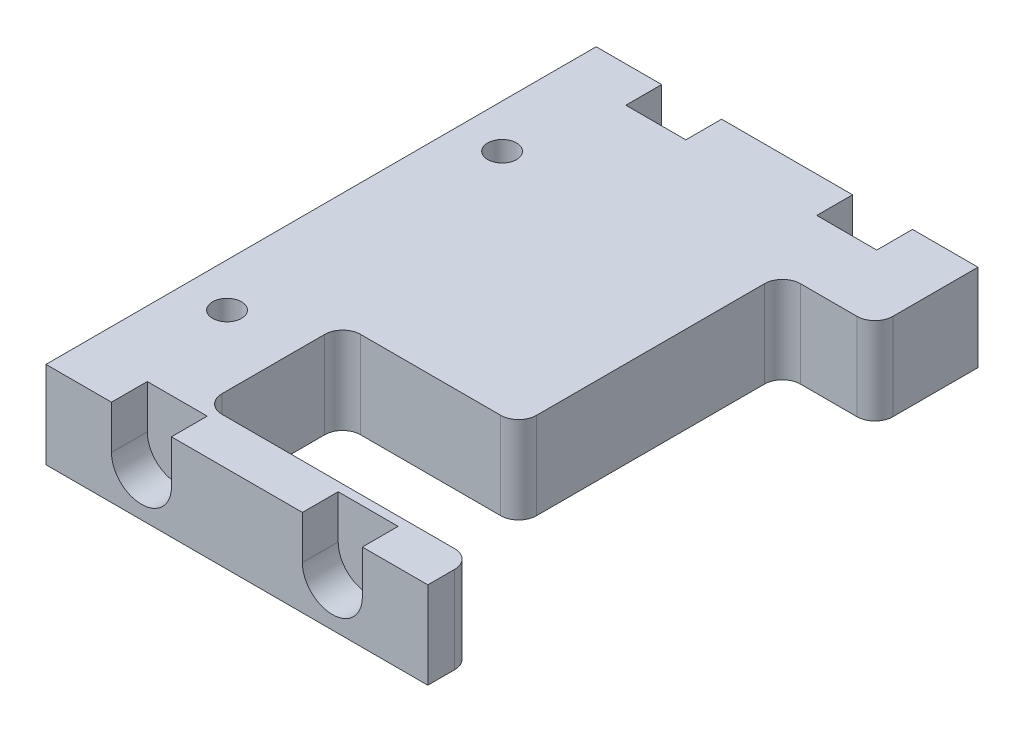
ISO-10303-21;
HEADER;
FILE_DESCRIPTION(('STEP AP214'),'2;1');
FILE_NAME('part.step','',(''),(''),'','','');
FILE_SCHEMA(('AUTOMOTIVE_DESIGN { 1 0 10303 214 1 1 1 1 }'));
ENDSEC;
DATA;
#1=APPLICATION_CONTEXT('core data for automotive mechanical design processes');
#2=APPLICATION_PROTOCOL_DEFINITION('international standard','automotive_design',2000,#1);
#3=PRODUCT_CONTEXT('',#1,'mechanical');
#4=PRODUCT('Part','Part','',(#3));
#5=PRODUCT_RELATED_PRODUCT_CATEGORY('part','',(#4));
#6=PRODUCT_DEFINITION_FORMATION('','',#4);
#7=PRODUCT_DEFINITION_CONTEXT('part definition',#1,'design');
#8=PRODUCT_DEFINITION('design','',#6,#7);
#9=PRODUCT_DEFINITION_SHAPE('','',#8);
#10=(LENGTH_UNIT() NAMED_UNIT(*) SI_UNIT(.MILLI.,.METRE.));
#11=(NAMED_UNIT(*) PLANE_ANGLE_UNIT() SI_UNIT($,.RADIAN.));
#12=(NAMED_UNIT(*) SI_UNIT($,.STERADIAN.) SOLID_ANGLE_UNIT());
#13=UNCERTAINTY_MEASURE_WITH_UNIT(LENGTH_MEASURE(1.E-05),#10,'distance_accuracy_value','');
#14=(GEOMETRIC_REPRESENTATION_CONTEXT(3) GLOBAL_UNCERTAINTY_ASSIGNED_CONTEXT((#13)) GLOBAL_UNIT_ASSIGNED_CONTEXT((#10,
#11,#12)) REPRESENTATION_CONTEXT('',''));
#15=CARTESIAN_POINT('',(0.,0.,0.));
#16=DIRECTION('',(0.,0.,1.));
#17=DIRECTION('',(1.,0.,0.));
#18=AXIS2_PLACEMENT_3D('',#15,#16,#17);
#19=CARTESIAN_POINT('',(-899.286453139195,561.091856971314,0.));
#20=DIRECTION('',(0.,1.,0.));
#21=DIRECTION('',(0.,0.,1.));
#22=AXIS2_PLACEMENT_3D('',#19,#20,#21);
#23=PLANE('',#22);
#24=CARTESIAN_POINT('',(-827.241549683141,561.091856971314,-58.5597));
#25=DIRECTION('',(0.,-1.,0.));
#26=DIRECTION('',(0.,0.,-1.));
#27=AXIS2_PLACEMENT_3D('',#24,#25,#26);
#28=CIRCLE('',#27,2.05000000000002);
#29=CARTESIAN_POINT('',(-827.241549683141,561.091856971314,-60.6097));
#30=VERTEX_POINT('',#29);
#31=EDGE_CURVE('E345',#30,#30,#28,.T.);
#32=ORIENTED_EDGE('',*,*,#31,.T.);
#33=EDGE_LOOP('',(#32));
#34=FACE_BOUND('',#33,.T.);
#35=CARTESIAN_POINT('',(-827.241549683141,561.091856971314,-19.5199));
#36=DIRECTION('',(0.,-1.,0.));
#37=DIRECTION('',(0.,0.,-1.));
#38=AXIS2_PLACEMENT_3D('',#35,#36,#37);
#39=CIRCLE('',#38,2.05000000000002);
#40=CARTESIAN_POINT('',(-827.241549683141,561.091856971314,-21.5699));
#41=VERTEX_POINT('',#40);
#42=EDGE_CURVE('E335',#41,#41,#39,.T.);
#43=ORIENTED_EDGE('',*,*,#42,.T.);
#44=EDGE_LOOP('',(#43));
#45=FACE_BOUND('',#44,.T.);
#46=DIRECTION('',(1.,0.,0.));
#47=VECTOR('',#46,1.);
#48=CARTESIAN_POINT('',(-899.286453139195,561.091856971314,0.));
#49=LINE('',#48,#47);
#50=CARTESIAN_POINT('',(-833.413749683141,561.091856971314,0.));
#51=VERTEX_POINT('',#50);
#52=CARTESIAN_POINT('',(-824.121059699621,561.091856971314,0.));
#53=VERTEX_POINT('',#52);
#54=EDGE_CURVE('E416',#51,#53,#49,.T.);
#55=ORIENTED_EDGE('',*,*,#54,.T.);
#56=DIRECTION('',(0.,0.,1.));
#57=VECTOR('',#56,1.);
#58=CARTESIAN_POINT('',(-824.121059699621,561.091856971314,-15.5918568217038));
#59=LINE('',#58,#57);
#60=CARTESIAN_POINT('',(-824.121059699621,561.091856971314,-5.08));
#61=VERTEX_POINT('',#60);
#62=EDGE_CURVE('E302',#61,#53,#59,.T.);
#63=ORIENTED_EDGE('',*,*,#62,.F.);
#64=DIRECTION('',(1.,0.,0.));
#65=VECTOR('',#64,1.);
#66=CARTESIAN_POINT('',(0.,561.091856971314,-5.08));
#67=LINE('',#66,#65);
#68=CARTESIAN_POINT('',(-815.612059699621,561.091856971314,-5.08));
#69=VERTEX_POINT('',#68);
#70=EDGE_CURVE('E669',#61,#69,#67,.T.);
#71=ORIENTED_EDGE('',*,*,#70,.T.);
#72=DIRECTION('',(0.,0.,1.));
#73=VECTOR('',#72,1.);
#74=CARTESIAN_POINT('',(-815.612059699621,561.091856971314,-15.5918568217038));
#75=LINE('',#74,#73);
#76=CARTESIAN_POINT('',(-815.612059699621,561.091856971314,0.));
#77=VERTEX_POINT('',#76);
#78=EDGE_CURVE('E590',#69,#77,#75,.T.);
#79=ORIENTED_EDGE('',*,*,#78,.T.);
#80=CARTESIAN_POINT('',(-797.026679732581,561.091856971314,0.));
#81=VERTEX_POINT('',#80);
#82=EDGE_CURVE('E419',#77,#81,#49,.T.);
#83=ORIENTED_EDGE('',*,*,#82,.T.);
#84=DIRECTION('',(0.,0.,1.));
#85=VECTOR('',#84,1.);
#86=CARTESIAN_POINT('',(-797.026679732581,561.091856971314,-15.5918568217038));
#87=LINE('',#86,#85);
#88=CARTESIAN_POINT('',(-797.026679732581,561.091856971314,-5.08));
#89=VERTEX_POINT('',#88);
#90=EDGE_CURVE('E588',#89,#81,#87,.T.);
#91=ORIENTED_EDGE('',*,*,#90,.F.);
#92=DIRECTION('',(1.,0.,0.));
#93=VECTOR('',#92,1.);
#94=CARTESIAN_POINT('',(0.,561.091856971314,-5.08));
#95=LINE('',#94,#93);
#96=CARTESIAN_POINT('',(-788.517679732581,561.091856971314,-5.08));
#97=VERTEX_POINT('',#96);
#98=EDGE_CURVE('E660',#89,#97,#95,.T.);
#99=ORIENTED_EDGE('',*,*,#98,.T.);
#100=DIRECTION('',(0.,0.,1.));
#101=VECTOR('',#100,1.);
#102=CARTESIAN_POINT('',(-788.517679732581,561.091856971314,-15.5918568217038));
#103=LINE('',#102,#101);
#104=CARTESIAN_POINT('',(-788.517679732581,561.091856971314,0.));
#105=VERTEX_POINT('',#104);
#106=EDGE_CURVE('E600',#97,#105,#103,.T.);
#107=ORIENTED_EDGE('',*,*,#106,.T.);
#108=CARTESIAN_POINT('',(-779.224989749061,561.091856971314,0.));
#109=VERTEX_POINT('',#108);
#110=EDGE_CURVE('E414',#105,#109,#49,.T.);
#111=ORIENTED_EDGE('',*,*,#110,.T.);
#112=DIRECTION('',(0.,0.,1.));
#113=VECTOR('',#112,1.);
#114=CARTESIAN_POINT('',(-779.224989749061,561.091856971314,0.));
#115=LINE('',#114,#113);
#116=CARTESIAN_POINT('',(-779.224989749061,561.091856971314,-3.81));
#117=VERTEX_POINT('',#116);
#118=EDGE_CURVE('E406',#117,#109,#115,.T.);
#119=ORIENTED_EDGE('',*,*,#118,.F.);
#120=CARTESIAN_POINT('',(-781.764989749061,561.091856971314,-3.81));
#121=DIRECTION('',(0.,1.,0.));
#122=DIRECTION('',(0.,0.,1.));
#123=AXIS2_PLACEMENT_3D('',#120,#121,#122);
#124=CIRCLE('',#123,2.54);
#125=CARTESIAN_POINT('',(-781.764989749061,561.091856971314,-6.35));
#126=VERTEX_POINT('',#125);
#127=EDGE_CURVE('E421',#117,#126,#124,.T.);
#128=ORIENTED_EDGE('',*,*,#127,.T.);
#129=DIRECTION('',(1.,0.,0.));
#130=VECTOR('',#129,1.);
#131=CARTESIAN_POINT('',(-899.286453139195,561.091856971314,-6.35));
#132=LINE('',#131,#130);
#133=CARTESIAN_POINT('',(-814.784989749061,561.091856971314,-6.35));
#134=VERTEX_POINT('',#133);
#135=EDGE_CURVE('E391',#134,#126,#132,.T.);
#136=ORIENTED_EDGE('',*,*,#135,.F.);
#137=CARTESIAN_POINT('',(-814.784989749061,561.091856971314,-8.89));
#138=DIRECTION('',(0.,1.,0.));
#139=DIRECTION('',(0.,0.,1.));
#140=AXIS2_PLACEMENT_3D('',#137,#138,#139);
#141=CIRCLE('',#140,2.54);
#142=CARTESIAN_POINT('',(-817.324989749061,561.091856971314,-8.89));
#143=VERTEX_POINT('',#142);
#144=EDGE_CURVE('E472',#134,#143,#141,.F.);
#145=ORIENTED_EDGE('',*,*,#144,.T.);
#146=DIRECTION('',(0.,0.,-1.));
#147=VECTOR('',#146,1.);
#148=CARTESIAN_POINT('',(-817.324989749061,561.091856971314,0.));
#149=LINE('',#148,#147);
#150=CARTESIAN_POINT('',(-817.324989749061,561.091856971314,-23.4689585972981));
#151=VERTEX_POINT('',#150);
#152=EDGE_CURVE('E386',#143,#151,#149,.T.);
#153=ORIENTED_EDGE('',*,*,#152,.T.);
#154=CARTESIAN_POINT('',(-814.784989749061,561.091856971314,-23.4689585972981));
#155=DIRECTION('',(0.,1.,0.));
#156=DIRECTION('',(0.,0.,1.));
#157=AXIS2_PLACEMENT_3D('',#154,#155,#156);
#158=CIRCLE('',#157,2.54);
#159=CARTESIAN_POINT('',(-814.784989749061,561.091856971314,-26.0089585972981));
#160=VERTEX_POINT('',#159);
#161=EDGE_CURVE('E468',#151,#160,#158,.F.);
#162=ORIENTED_EDGE('',*,*,#161,.T.);
#163=DIRECTION('',(1.,0.,0.));
#164=VECTOR('',#163,1.);
#165=CARTESIAN_POINT('',(0.,561.091856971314,-26.0089585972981));
#166=LINE('',#165,#164);
#167=CARTESIAN_POINT('',(-794.887866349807,561.091856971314,-26.0089585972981));
#168=VERTEX_POINT('',#167);
#169=EDGE_CURVE('E353',#160,#168,#166,.T.);
#170=ORIENTED_EDGE('',*,*,#169,.T.);
#171=CARTESIAN_POINT('',(-794.887866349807,561.091856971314,-28.5489585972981));
#172=DIRECTION('',(0.,1.,0.));
#173=DIRECTION('',(0.,0.,1.));
#174=AXIS2_PLACEMENT_3D('',#171,#172,#173);
#175=CIRCLE('',#174,2.54);
#176=CARTESIAN_POINT('',(-792.347866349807,561.091856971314,-28.5489585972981));
#177=VERTEX_POINT('',#176);
#178=EDGE_CURVE('E441',#168,#177,#175,.T.);
#179=ORIENTED_EDGE('',*,*,#178,.T.);
#180=DIRECTION('',(0.,0.,1.));
#181=VECTOR('',#180,1.);
#182=CARTESIAN_POINT('',(-792.347866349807,561.091856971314,0.));
#183=LINE('',#182,#181);
#184=CARTESIAN_POINT('',(-792.347866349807,561.091856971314,-60.9129986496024));
#185=VERTEX_POINT('',#184);
#186=EDGE_CURVE('E357',#185,#177,#183,.T.);
#187=ORIENTED_EDGE('',*,*,#186,.F.);
#188=CARTESIAN_POINT('',(-789.807866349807,561.091856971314,-60.9129986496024));
#189=DIRECTION('',(0.,1.,0.));
#190=DIRECTION('',(0.,0.,1.));
#191=AXIS2_PLACEMENT_3D('',#188,#189,#190);
#192=CIRCLE('',#191,2.54);
#193=CARTESIAN_POINT('',(-789.807866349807,561.091856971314,-63.4529986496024));
#194=VERTEX_POINT('',#193);
#195=EDGE_CURVE('E464',#185,#194,#192,.F.);
#196=ORIENTED_EDGE('',*,*,#195,.T.);
#197=DIRECTION('',(-1.,0.,0.));
#198=VECTOR('',#197,1.);
#199=CARTESIAN_POINT('',(0.,561.091856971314,-63.4529986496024));
#200=LINE('',#199,#198);
#201=CARTESIAN_POINT('',(-781.764989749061,561.091856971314,-63.4529986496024));
#202=VERTEX_POINT('',#201);
#203=EDGE_CURVE('E360',#202,#194,#200,.T.);
#204=ORIENTED_EDGE('',*,*,#203,.F.);
#205=CARTESIAN_POINT('',(-781.764989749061,561.091856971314,-65.9929986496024));
#206=DIRECTION('',(0.,1.,0.));
#207=DIRECTION('',(0.,0.,1.));
#208=AXIS2_PLACEMENT_3D('',#205,#206,#207);
#209=CIRCLE('',#208,2.54);
#210=CARTESIAN_POINT('',(-779.224989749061,561.091856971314,-65.9929986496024));
#211=VERTEX_POINT('',#210);
#212=EDGE_CURVE('E443',#202,#211,#209,.T.);
#213=ORIENTED_EDGE('',*,*,#212,.T.);
#214=CARTESIAN_POINT('',(-779.224989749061,561.091856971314,-78.0796));
#215=VERTEX_POINT('',#214);
#216=EDGE_CURVE('E407',#215,#211,#115,.T.);
#217=ORIENTED_EDGE('',*,*,#216,.F.);
#218=DIRECTION('',(-1.,0.,0.));
#219=VECTOR('',#218,1.);
#220=CARTESIAN_POINT('',(-899.286453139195,561.091856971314,-78.0796));
#221=LINE('',#220,#219);
#222=CARTESIAN_POINT('',(-788.517679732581,561.091856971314,-78.0796));
#223=VERTEX_POINT('',#222);
#224=EDGE_CURVE('E411',#215,#223,#221,.T.);
#225=ORIENTED_EDGE('',*,*,#224,.T.);
#226=DIRECTION('',(0.,0.,-1.));
#227=VECTOR('',#226,1.);
#228=CARTESIAN_POINT('',(-788.517679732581,561.091856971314,-62.4877431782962));
#229=LINE('',#228,#227);
#230=CARTESIAN_POINT('',(-788.517679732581,561.091856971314,-72.9996));
#231=VERTEX_POINT('',#230);
#232=EDGE_CURVE('E631',#231,#223,#229,.T.);
#233=ORIENTED_EDGE('',*,*,#232,.F.);
#234=DIRECTION('',(-1.,0.,0.));
#235=VECTOR('',#234,1.);
#236=CARTESIAN_POINT('',(0.,561.091856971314,-72.9996));
#237=LINE('',#236,#235);
#238=CARTESIAN_POINT('',(-797.026679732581,561.091856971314,-72.9996));
#239=VERTEX_POINT('',#238);
#240=EDGE_CURVE('E630',#231,#239,#237,.T.);
#241=ORIENTED_EDGE('',*,*,#240,.T.);
#242=DIRECTION('',(0.,0.,-1.));
#243=VECTOR('',#242,1.);
#244=CARTESIAN_POINT('',(-797.026679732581,561.091856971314,-62.4877431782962));
#245=LINE('',#244,#243);
#246=CARTESIAN_POINT('',(-797.026679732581,561.091856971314,-78.0796));
#247=VERTEX_POINT('',#246);
#248=EDGE_CURVE('E644',#239,#247,#245,.T.);
#249=ORIENTED_EDGE('',*,*,#248,.T.);
#250=CARTESIAN_POINT('',(-815.612059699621,561.091856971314,-78.0796));
#251=VERTEX_POINT('',#250);
#252=EDGE_CURVE('E415',#247,#251,#221,.T.);
#253=ORIENTED_EDGE('',*,*,#252,.T.);
#254=DIRECTION('',(0.,0.,-1.));
#255=VECTOR('',#254,1.);
#256=CARTESIAN_POINT('',(-815.612059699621,561.091856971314,-62.4877431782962));
#257=LINE('',#256,#255);
#258=CARTESIAN_POINT('',(-815.612059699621,561.091856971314,-72.9996));
#259=VERTEX_POINT('',#258);
#260=EDGE_CURVE('E608',#259,#251,#257,.T.);
#261=ORIENTED_EDGE('',*,*,#260,.F.);
#262=DIRECTION('',(-1.,0.,0.));
#263=VECTOR('',#262,1.);
#264=CARTESIAN_POINT('',(0.,561.091856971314,-72.9996));
#265=LINE('',#264,#263);
#266=CARTESIAN_POINT('',(-824.121059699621,561.091856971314,-72.9996));
#267=VERTEX_POINT('',#266);
#268=EDGE_CURVE('E607',#259,#267,#265,.T.);
#269=ORIENTED_EDGE('',*,*,#268,.T.);
#270=DIRECTION('',(0.,0.,-1.));
#271=VECTOR('',#270,1.);
#272=CARTESIAN_POINT('',(-824.121059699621,561.091856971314,-62.4877431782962));
#273=LINE('',#272,#271);
#274=CARTESIAN_POINT('',(-824.121059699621,561.091856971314,-78.0796));
#275=VERTEX_POINT('',#274);
#276=EDGE_CURVE('E621',#267,#275,#273,.T.);
#277=ORIENTED_EDGE('',*,*,#276,.T.);
#278=CARTESIAN_POINT('',(-833.413749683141,561.091856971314,-78.0796));
#279=VERTEX_POINT('',#278);
#280=EDGE_CURVE('E410',#275,#279,#221,.T.);
#281=ORIENTED_EDGE('',*,*,#280,.T.);
#282=DIRECTION('',(0.,0.,-1.));
#283=VECTOR('',#282,1.);
#284=CARTESIAN_POINT('',(-833.413749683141,561.091856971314,0.));
#285=LINE('',#284,#283);
#286=EDGE_CURVE('E364',#51,#279,#285,.T.);
#287=ORIENTED_EDGE('',*,*,#286,.F.);
#288=EDGE_LOOP('',(#55,#63,#71,#79,#83,#91,#99,#107,#111,#119,#128,#136,#145,#153,#162,#170,
#179,#187,#196,#204,#213,#217,#225,#233,#241,#249,#253,#261,#269,#277,#281,#287));
#289=FACE_BOUND('',#288,.T.);
#290=ADVANCED_FACE('F91',(#34,#45,#289),#23,.T.);
#291=CARTESIAN_POINT('',(0.,0.,0.));
#292=DIRECTION('',(0.,0.,1.));
#293=DIRECTION('',(1.,0.,0.));
#294=AXIS2_PLACEMENT_3D('',#291,#292,#293);
#295=PLANE('',#294);
#296=CARTESIAN_POINT('',(-819.866559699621,554.919656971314,0.));
#297=DIRECTION('',(0.,0.,1.));
#298=DIRECTION('',(1.,0.,0.));
#299=AXIS2_PLACEMENT_3D('',#296,#297,#298);
#300=CIRCLE('',#299,4.25450000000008);
#301=CARTESIAN_POINT('',(-824.121059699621,554.919656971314,0.));
#302=VERTEX_POINT('',#301);
#303=CARTESIAN_POINT('',(-815.612059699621,554.919656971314,0.));
#304=VERTEX_POINT('',#303);
#305=EDGE_CURVE('E315',#302,#304,#300,.T.);
#306=ORIENTED_EDGE('',*,*,#305,.F.);
#307=DIRECTION('',(0.,1.,0.));
#308=VECTOR('',#307,1.);
#309=CARTESIAN_POINT('',(-824.121059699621,0.,0.));
#310=LINE('',#309,#308);
#311=EDGE_CURVE('E299',#302,#53,#310,.T.);
#312=ORIENTED_EDGE('',*,*,#311,.T.);
#313=ORIENTED_EDGE('',*,*,#54,.F.);
#314=DIRECTION('',(0.,1.,0.));
#315=VECTOR('',#314,1.);
#316=CARTESIAN_POINT('',(-833.413749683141,0.,0.));
#317=LINE('',#316,#315);
#318=CARTESIAN_POINT('',(-833.413749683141,548.747456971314,0.));
#319=VERTEX_POINT('',#318);
#320=EDGE_CURVE('E371',#319,#51,#317,.T.);
#321=ORIENTED_EDGE('',*,*,#320,.F.);
#322=DIRECTION('',(-1.,0.,0.));
#323=VECTOR('',#322,1.);
#324=CARTESIAN_POINT('',(0.,548.747456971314,0.));
#325=LINE('',#324,#323);
#326=CARTESIAN_POINT('',(-779.224989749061,548.747456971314,0.));
#327=VERTEX_POINT('',#326);
#328=EDGE_CURVE('E376',#327,#319,#325,.T.);
#329=ORIENTED_EDGE('',*,*,#328,.F.);
#330=DIRECTION('',(0.,-1.,0.));
#331=VECTOR('',#330,1.);
#332=CARTESIAN_POINT('',(-779.224989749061,0.,0.));
#333=LINE('',#332,#331);
#334=EDGE_CURVE('E394',#109,#327,#333,.T.);
#335=ORIENTED_EDGE('',*,*,#334,.F.);
#336=ORIENTED_EDGE('',*,*,#110,.F.);
#337=DIRECTION('',(0.,1.,0.));
#338=VECTOR('',#337,1.);
#339=CARTESIAN_POINT('',(-788.517679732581,0.,0.));
#340=LINE('',#339,#338);
#341=CARTESIAN_POINT('',(-788.517679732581,554.919656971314,0.));
#342=VERTEX_POINT('',#341);
#343=EDGE_CURVE('E582',#342,#105,#340,.T.);
#344=ORIENTED_EDGE('',*,*,#343,.F.);
#345=CARTESIAN_POINT('',(-792.772179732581,554.919656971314,0.));
#346=DIRECTION('',(0.,0.,1.));
#347=DIRECTION('',(1.,0.,0.));
#348=AXIS2_PLACEMENT_3D('',#345,#346,#347);
#349=CIRCLE('',#348,4.25450000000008);
#350=CARTESIAN_POINT('',(-797.026679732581,554.919656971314,0.));
#351=VERTEX_POINT('',#350);
#352=EDGE_CURVE('E323',#351,#342,#349,.T.);
#353=ORIENTED_EDGE('',*,*,#352,.F.);
#354=DIRECTION('',(0.,1.,0.));
#355=VECTOR('',#354,1.);
#356=CARTESIAN_POINT('',(-797.026679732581,0.,0.));
#357=LINE('',#356,#355);
#358=EDGE_CURVE('E592',#351,#81,#357,.T.);
#359=ORIENTED_EDGE('',*,*,#358,.T.);
#360=ORIENTED_EDGE('',*,*,#82,.F.);
#361=DIRECTION('',(0.,1.,0.));
#362=VECTOR('',#361,1.);
#363=CARTESIAN_POINT('',(-815.612059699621,0.,0.));
#364=LINE('',#363,#362);
#365=EDGE_CURVE('E307',#304,#77,#364,.T.);
#366=ORIENTED_EDGE('',*,*,#365,.F.);
#367=EDGE_LOOP('',(#306,#312,#313,#321,#329,#335,#336,#344,#353,#359,#360,#366));
#368=FACE_BOUND('',#367,.T.);
#369=ADVANCED_FACE('F321',(#368),#295,.T.);
#370=CARTESIAN_POINT('',(-819.866559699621,554.919656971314,-5.08));
#371=DIRECTION('',(0.,0.,1.));
#372=DIRECTION('',(1.,0.,0.));
#373=AXIS2_PLACEMENT_3D('',#370,#371,#372);
#374=CYLINDRICAL_SURFACE('',#373,4.25450000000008);
#375=DIRECTION('',(0.,0.,1.));
#376=VECTOR('',#375,1.);
#377=CARTESIAN_POINT('',(-824.121059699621,554.919656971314,-15.5918568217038));
#378=LINE('',#377,#376);
#379=CARTESIAN_POINT('',(-824.121059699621,554.919656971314,-5.08));
#380=VERTEX_POINT('',#379);
#381=EDGE_CURVE('E107',#380,#302,#378,.T.);
#382=ORIENTED_EDGE('',*,*,#381,.T.);
#383=ORIENTED_EDGE('',*,*,#305,.T.);
#384=DIRECTION('',(0.,0.,1.));
#385=VECTOR('',#384,1.);
#386=CARTESIAN_POINT('',(-815.612059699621,554.919656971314,-15.5918568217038));
#387=LINE('',#386,#385);
#388=CARTESIAN_POINT('',(-815.612059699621,554.919656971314,-5.08));
#389=VERTEX_POINT('',#388);
#390=EDGE_CURVE('E318',#389,#304,#387,.T.);
#391=ORIENTED_EDGE('',*,*,#390,.F.);
#392=CARTESIAN_POINT('',(-819.866559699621,554.919656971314,-5.08));
#393=DIRECTION('',(0.,0.,1.));
#394=DIRECTION('',(1.,0.,0.));
#395=AXIS2_PLACEMENT_3D('',#392,#393,#394);
#396=CIRCLE('',#395,4.25450000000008);
#397=EDGE_CURVE('E317',#380,#389,#396,.T.);
#398=ORIENTED_EDGE('',*,*,#397,.F.);
#399=EDGE_LOOP('',(#382,#383,#391,#398));
#400=FACE_BOUND('',#399,.T.);
#401=ADVANCED_FACE('F313',(#400),#374,.F.);
#402=CARTESIAN_POINT('',(-792.772179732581,554.919656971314,-5.08));
#403=DIRECTION('',(0.,0.,1.));
#404=DIRECTION('',(1.,0.,0.));
#405=AXIS2_PLACEMENT_3D('',#402,#403,#404);
#406=CYLINDRICAL_SURFACE('',#405,4.25450000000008);
#407=DIRECTION('',(0.,0.,1.));
#408=VECTOR('',#407,1.);
#409=CARTESIAN_POINT('',(-797.026679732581,554.919656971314,-15.5918568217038));
#410=LINE('',#409,#408);
#411=CARTESIAN_POINT('',(-797.026679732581,554.919656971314,-5.08));
#412=VERTEX_POINT('',#411);
#413=EDGE_CURVE('E115',#412,#351,#410,.T.);
#414=ORIENTED_EDGE('',*,*,#413,.T.);
#415=ORIENTED_EDGE('',*,*,#352,.T.);
#416=DIRECTION('',(0.,0.,1.));
#417=VECTOR('',#416,1.);
#418=CARTESIAN_POINT('',(-788.517679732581,554.919656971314,-15.5918568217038));
#419=LINE('',#418,#417);
#420=CARTESIAN_POINT('',(-788.517679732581,554.919656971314,-5.08));
#421=VERTEX_POINT('',#420);
#422=EDGE_CURVE('E602',#421,#342,#419,.T.);
#423=ORIENTED_EDGE('',*,*,#422,.F.);
#424=CARTESIAN_POINT('',(-792.772179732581,554.919656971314,-5.08));
#425=DIRECTION('',(0.,0.,1.));
#426=DIRECTION('',(1.,0.,0.));
#427=AXIS2_PLACEMENT_3D('',#424,#425,#426);
#428=CIRCLE('',#427,4.25450000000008);
#429=EDGE_CURVE('E326',#412,#421,#428,.T.);
#430=ORIENTED_EDGE('',*,*,#429,.F.);
#431=EDGE_LOOP('',(#414,#415,#423,#430));
#432=FACE_BOUND('',#431,.T.);
#433=ADVANCED_FACE('F657',(#432),#406,.F.);
#434=CARTESIAN_POINT('',(0.,0.,-78.0796));
#435=DIRECTION('',(0.,0.,-1.));
#436=DIRECTION('',(-1.,0.,0.));
#437=AXIS2_PLACEMENT_3D('',#434,#435,#436);
#438=PLANE('',#437);
#439=CARTESIAN_POINT('',(-819.866559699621,554.919656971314,-78.0796));
#440=DIRECTION('',(0.,0.,-1.));
#441=DIRECTION('',(-1.,0.,0.));
#442=AXIS2_PLACEMENT_3D('',#439,#440,#441);
#443=CIRCLE('',#442,4.25450000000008);
#444=CARTESIAN_POINT('',(-815.612059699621,554.919656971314,-78.0796));
#445=VERTEX_POINT('',#444);
#446=CARTESIAN_POINT('',(-824.121059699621,554.919656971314,-78.0796));
#447=VERTEX_POINT('',#446);
#448=EDGE_CURVE('E336',#445,#447,#443,.T.);
#449=ORIENTED_EDGE('',*,*,#448,.F.);
#450=DIRECTION('',(0.,1.,0.));
#451=VECTOR('',#450,1.);
#452=CARTESIAN_POINT('',(-815.612059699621,0.,-78.0796));
#453=LINE('',#452,#451);
#454=EDGE_CURVE('E613',#445,#251,#453,.T.);
#455=ORIENTED_EDGE('',*,*,#454,.T.);
#456=ORIENTED_EDGE('',*,*,#252,.F.);
#457=DIRECTION('',(0.,1.,0.));
#458=VECTOR('',#457,1.);
#459=CARTESIAN_POINT('',(-797.026679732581,0.,-78.0796));
#460=LINE('',#459,#458);
#461=CARTESIAN_POINT('',(-797.026679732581,554.919656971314,-78.0796));
#462=VERTEX_POINT('',#461);
#463=EDGE_CURVE('E639',#462,#247,#460,.T.);
#464=ORIENTED_EDGE('',*,*,#463,.F.);
#465=CARTESIAN_POINT('',(-792.772179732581,554.919656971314,-78.0796));
#466=DIRECTION('',(0.,0.,-1.));
#467=DIRECTION('',(-1.,0.,0.));
#468=AXIS2_PLACEMENT_3D('',#465,#466,#467);
#469=CIRCLE('',#468,4.25450000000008);
#470=CARTESIAN_POINT('',(-788.517679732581,554.919656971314,-78.0796));
#471=VERTEX_POINT('',#470);
#472=EDGE_CURVE('E339',#471,#462,#469,.T.);
#473=ORIENTED_EDGE('',*,*,#472,.F.);
#474=DIRECTION('',(0.,1.,0.));
#475=VECTOR('',#474,1.);
#476=CARTESIAN_POINT('',(-788.517679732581,0.,-78.0796));
#477=LINE('',#476,#475);
#478=EDGE_CURVE('E636',#471,#223,#477,.T.);
#479=ORIENTED_EDGE('',*,*,#478,.T.);
#480=ORIENTED_EDGE('',*,*,#224,.F.);
#481=DIRECTION('',(0.,-1.,0.));
#482=VECTOR('',#481,1.);
#483=CARTESIAN_POINT('',(-779.224989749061,562.158656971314,-78.0796));
#484=LINE('',#483,#482);
#485=CARTESIAN_POINT('',(-779.224989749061,548.747456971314,-78.0796));
#486=VERTEX_POINT('',#485);
#487=EDGE_CURVE('E393',#215,#486,#484,.T.);
#488=ORIENTED_EDGE('',*,*,#487,.T.);
#489=DIRECTION('',(1.,0.,0.));
#490=VECTOR('',#489,1.);
#491=CARTESIAN_POINT('',(0.,548.747456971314,-78.0796));
#492=LINE('',#491,#490);
#493=CARTESIAN_POINT('',(-833.413749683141,548.747456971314,-78.0796));
#494=VERTEX_POINT('',#493);
#495=EDGE_CURVE('E375',#494,#486,#492,.T.);
#496=ORIENTED_EDGE('',*,*,#495,.F.);
#497=DIRECTION('',(0.,-1.,0.));
#498=VECTOR('',#497,1.);
#499=CARTESIAN_POINT('',(-833.413749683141,0.,-78.0796));
#500=LINE('',#499,#498);
#501=EDGE_CURVE('E372',#279,#494,#500,.T.);
#502=ORIENTED_EDGE('',*,*,#501,.F.);
#503=ORIENTED_EDGE('',*,*,#280,.F.);
#504=DIRECTION('',(0.,1.,0.));
#505=VECTOR('',#504,1.);
#506=CARTESIAN_POINT('',(-824.121059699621,0.,-78.0796));
#507=LINE('',#506,#505);
#508=EDGE_CURVE('E616',#447,#275,#507,.T.);
#509=ORIENTED_EDGE('',*,*,#508,.F.);
#510=EDGE_LOOP('',(#449,#455,#456,#464,#473,#479,#480,#488,#496,#502,#503,#509));
#511=FACE_BOUND('',#510,.T.);
#512=ADVANCED_FACE('F518',(#511),#438,.T.);
#513=CARTESIAN_POINT('',(-792.772179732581,554.919656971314,-72.9996));
#514=DIRECTION('',(0.,0.,-1.));
#515=DIRECTION('',(-1.,0.,0.));
#516=AXIS2_PLACEMENT_3D('',#513,#514,#515);
#517=CYLINDRICAL_SURFACE('',#516,4.25450000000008);
#518=DIRECTION('',(0.,0.,-1.));
#519=VECTOR('',#518,1.);
#520=CARTESIAN_POINT('',(-788.517679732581,554.919656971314,-62.4877431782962));
#521=LINE('',#520,#519);
#522=CARTESIAN_POINT('',(-788.517679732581,554.919656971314,-72.9996));
#523=VERTEX_POINT('',#522);
#524=EDGE_CURVE('E642',#523,#471,#521,.T.);
#525=ORIENTED_EDGE('',*,*,#524,.T.);
#526=ORIENTED_EDGE('',*,*,#472,.T.);
#527=DIRECTION('',(0.,0.,-1.));
#528=VECTOR('',#527,1.);
#529=CARTESIAN_POINT('',(-797.026679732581,554.919656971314,-62.4877431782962));
#530=LINE('',#529,#528);
#531=CARTESIAN_POINT('',(-797.026679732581,554.919656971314,-72.9996));
#532=VERTEX_POINT('',#531);
#533=EDGE_CURVE('E647',#532,#462,#530,.T.);
#534=ORIENTED_EDGE('',*,*,#533,.F.);
#535=CARTESIAN_POINT('',(-792.772179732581,554.919656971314,-72.9996));
#536=DIRECTION('',(0.,0.,-1.));
#537=DIRECTION('',(-1.,0.,0.));
#538=AXIS2_PLACEMENT_3D('',#535,#536,#537);
#539=CIRCLE('',#538,4.25450000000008);
#540=EDGE_CURVE('E342',#523,#532,#539,.T.);
#541=ORIENTED_EDGE('',*,*,#540,.F.);
#542=EDGE_LOOP('',(#525,#526,#534,#541));
#543=FACE_BOUND('',#542,.T.);
#544=ADVANCED_FACE('F693',(#543),#517,.F.);
#545=CARTESIAN_POINT('',(-819.866559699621,554.919656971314,-72.9996));
#546=DIRECTION('',(0.,0.,-1.));
#547=DIRECTION('',(-1.,0.,0.));
#548=AXIS2_PLACEMENT_3D('',#545,#546,#547);
#549=CYLINDRICAL_SURFACE('',#548,4.25450000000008);
#550=DIRECTION('',(0.,0.,-1.));
#551=VECTOR('',#550,1.);
#552=CARTESIAN_POINT('',(-815.612059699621,554.919656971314,-62.4877431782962));
#553=LINE('',#552,#551);
#554=CARTESIAN_POINT('',(-815.612059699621,554.919656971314,-72.9996));
#555=VERTEX_POINT('',#554);
#556=EDGE_CURVE('E619',#555,#445,#553,.T.);
#557=ORIENTED_EDGE('',*,*,#556,.T.);
#558=ORIENTED_EDGE('',*,*,#448,.T.);
#559=DIRECTION('',(0.,0.,-1.));
#560=VECTOR('',#559,1.);
#561=CARTESIAN_POINT('',(-824.121059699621,554.919656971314,-62.4877431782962));
#562=LINE('',#561,#560);
#563=CARTESIAN_POINT('',(-824.121059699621,554.919656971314,-72.9996));
#564=VERTEX_POINT('',#563);
#565=EDGE_CURVE('E624',#564,#447,#562,.T.);
#566=ORIENTED_EDGE('',*,*,#565,.F.);
#567=CARTESIAN_POINT('',(-819.866559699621,554.919656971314,-72.9996));
#568=DIRECTION('',(0.,0.,-1.));
#569=DIRECTION('',(-1.,0.,0.));
#570=AXIS2_PLACEMENT_3D('',#567,#568,#569);
#571=CIRCLE('',#570,4.25450000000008);
#572=EDGE_CURVE('E332',#555,#564,#571,.T.);
#573=ORIENTED_EDGE('',*,*,#572,.F.);
#574=EDGE_LOOP('',(#557,#558,#566,#573));
#575=FACE_BOUND('',#574,.T.);
#576=ADVANCED_FACE('F690',(#575),#549,.F.);
#577=CARTESIAN_POINT('',(-817.324989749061,637.016869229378,0.));
#578=DIRECTION('',(1.,0.,0.));
#579=DIRECTION('',(0.,0.,-1.));
#580=AXIS2_PLACEMENT_3D('',#577,#578,#579);
#581=PLANE('',#580);
#582=DIRECTION('',(0.,0.,1.));
#583=VECTOR('',#582,1.);
#584=CARTESIAN_POINT('',(-817.324989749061,548.747456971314,0.));
#585=LINE('',#584,#583);
#586=CARTESIAN_POINT('',(-817.324989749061,548.747456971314,-23.4689585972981));
#587=VERTEX_POINT('',#586);
#588=CARTESIAN_POINT('',(-817.324989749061,548.747456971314,-8.89));
#589=VERTEX_POINT('',#588);
#590=EDGE_CURVE('E383',#587,#589,#585,.T.);
#591=ORIENTED_EDGE('',*,*,#590,.F.);
#592=DIRECTION('',(0.,-1.,0.));
#593=VECTOR('',#592,1.);
#594=CARTESIAN_POINT('',(-817.324989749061,637.016869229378,-23.4689585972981));
#595=LINE('',#594,#593);
#596=EDGE_CURVE('E458',#587,#151,#595,.F.);
#597=ORIENTED_EDGE('',*,*,#596,.T.);
#598=ORIENTED_EDGE('',*,*,#152,.F.);
#599=DIRECTION('',(0.,-1.,0.));
#600=VECTOR('',#599,1.);
#601=CARTESIAN_POINT('',(-817.324989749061,637.016869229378,-8.89));
#602=LINE('',#601,#600);
#603=EDGE_CURVE('E455',#143,#589,#602,.T.);
#604=ORIENTED_EDGE('',*,*,#603,.T.);
#605=EDGE_LOOP('',(#591,#597,#598,#604));
#606=FACE_BOUND('',#605,.T.);
#607=ADVANCED_FACE('F559',(#606),#581,.T.);
#608=CARTESIAN_POINT('',(0.,548.747456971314,0.));
#609=DIRECTION('',(0.,-1.,0.));
#610=DIRECTION('',(0.,0.,-1.));
#611=AXIS2_PLACEMENT_3D('',#608,#609,#610);
#612=PLANE('',#611);
#613=CARTESIAN_POINT('',(-827.241549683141,548.747456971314,-58.5597));
#614=DIRECTION('',(0.,-1.,0.));
#615=DIRECTION('',(0.,0.,-1.));
#616=AXIS2_PLACEMENT_3D('',#613,#614,#615);
#617=CIRCLE('',#616,3.31999999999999);
#618=CARTESIAN_POINT('',(-827.241549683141,548.747456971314,-61.8797));
#619=VERTEX_POINT('',#618);
#620=EDGE_CURVE('E100',#619,#619,#617,.F.);
#621=ORIENTED_EDGE('',*,*,#620,.T.);
#622=EDGE_LOOP('',(#621));
#623=FACE_BOUND('',#622,.T.);
#624=CARTESIAN_POINT('',(-827.241549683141,548.747456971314,-19.5199));
#625=DIRECTION('',(0.,-1.,0.));
#626=DIRECTION('',(0.,0.,-1.));
#627=AXIS2_PLACEMENT_3D('',#624,#625,#626);
#628=CIRCLE('',#627,3.31999999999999);
#629=CARTESIAN_POINT('',(-827.241549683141,548.747456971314,-22.8399));
#630=VERTEX_POINT('',#629);
#631=EDGE_CURVE('E477',#630,#630,#628,.F.);
#632=ORIENTED_EDGE('',*,*,#631,.T.);
#633=EDGE_LOOP('',(#632));
#634=FACE_BOUND('',#633,.T.);
#635=DIRECTION('',(0.,0.,1.));
#636=VECTOR('',#635,1.);
#637=CARTESIAN_POINT('',(-779.224989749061,548.747456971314,-84.4296));
#638=LINE('',#637,#636);
#639=CARTESIAN_POINT('',(-779.224989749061,548.747456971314,-65.9929986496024));
#640=VERTEX_POINT('',#639);
#641=EDGE_CURVE('E403',#486,#640,#638,.T.);
#642=ORIENTED_EDGE('',*,*,#641,.T.);
#643=CARTESIAN_POINT('',(-781.764989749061,548.747456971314,-65.9929986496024));
#644=DIRECTION('',(0.,-1.,0.));
#645=DIRECTION('',(0.,0.,-1.));
#646=AXIS2_PLACEMENT_3D('',#643,#644,#645);
#647=CIRCLE('',#646,2.54);
#648=CARTESIAN_POINT('',(-781.764989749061,548.747456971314,-63.4529986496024));
#649=VERTEX_POINT('',#648);
#650=EDGE_CURVE('E434',#640,#649,#647,.T.);
#651=ORIENTED_EDGE('',*,*,#650,.T.);
#652=DIRECTION('',(-1.,0.,0.));
#653=VECTOR('',#652,1.);
#654=CARTESIAN_POINT('',(0.,548.747456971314,-63.4529986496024));
#655=LINE('',#654,#653);
#656=CARTESIAN_POINT('',(-789.807866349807,548.747456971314,-63.4529986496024));
#657=VERTEX_POINT('',#656);
#658=EDGE_CURVE('E361',#649,#657,#655,.T.);
#659=ORIENTED_EDGE('',*,*,#658,.T.);
#660=CARTESIAN_POINT('',(-789.807866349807,548.747456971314,-60.9129986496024));
#661=DIRECTION('',(0.,-1.,0.));
#662=DIRECTION('',(0.,0.,-1.));
#663=AXIS2_PLACEMENT_3D('',#660,#661,#662);
#664=CIRCLE('',#663,2.54);
#665=CARTESIAN_POINT('',(-792.347866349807,548.747456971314,-60.9129986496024));
#666=VERTEX_POINT('',#665);
#667=EDGE_CURVE('E462',#657,#666,#664,.F.);
#668=ORIENTED_EDGE('',*,*,#667,.T.);
#669=DIRECTION('',(0.,0.,1.));
#670=VECTOR('',#669,1.);
#671=CARTESIAN_POINT('',(-792.347866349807,548.747456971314,0.));
#672=LINE('',#671,#670);
#673=CARTESIAN_POINT('',(-792.347866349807,548.747456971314,-28.5489585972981));
#674=VERTEX_POINT('',#673);
#675=EDGE_CURVE('E356',#666,#674,#672,.T.);
#676=ORIENTED_EDGE('',*,*,#675,.T.);
#677=CARTESIAN_POINT('',(-794.887866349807,548.747456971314,-28.5489585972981));
#678=DIRECTION('',(0.,-1.,0.));
#679=DIRECTION('',(0.,0.,-1.));
#680=AXIS2_PLACEMENT_3D('',#677,#678,#679);
#681=CIRCLE('',#680,2.54);
#682=CARTESIAN_POINT('',(-794.887866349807,548.747456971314,-26.0089585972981));
#683=VERTEX_POINT('',#682);
#684=EDGE_CURVE('E432',#674,#683,#681,.T.);
#685=ORIENTED_EDGE('',*,*,#684,.T.);
#686=DIRECTION('',(1.,0.,0.));
#687=VECTOR('',#686,1.);
#688=CARTESIAN_POINT('',(0.,548.747456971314,-26.0089585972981));
#689=LINE('',#688,#687);
#690=CARTESIAN_POINT('',(-814.784989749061,548.747456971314,-26.0089585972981));
#691=VERTEX_POINT('',#690);
#692=EDGE_CURVE('E348',#691,#683,#689,.T.);
#693=ORIENTED_EDGE('',*,*,#692,.F.);
#694=CARTESIAN_POINT('',(-814.784989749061,548.747456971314,-23.4689585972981));
#695=DIRECTION('',(0.,-1.,0.));
#696=DIRECTION('',(0.,0.,-1.));
#697=AXIS2_PLACEMENT_3D('',#694,#695,#696);
#698=CIRCLE('',#697,2.54);
#699=EDGE_CURVE('E466',#691,#587,#698,.F.);
#700=ORIENTED_EDGE('',*,*,#699,.T.);
#701=ORIENTED_EDGE('',*,*,#590,.T.);
#702=CARTESIAN_POINT('',(-814.784989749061,548.747456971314,-8.89));
#703=DIRECTION('',(0.,-1.,0.));
#704=DIRECTION('',(0.,0.,-1.));
#705=AXIS2_PLACEMENT_3D('',#702,#703,#704);
#706=CIRCLE('',#705,2.54);
#707=CARTESIAN_POINT('',(-814.784989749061,548.747456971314,-6.35));
#708=VERTEX_POINT('',#707);
#709=EDGE_CURVE('E470',#589,#708,#706,.F.);
#710=ORIENTED_EDGE('',*,*,#709,.T.);
#711=DIRECTION('',(-1.,0.,0.));
#712=VECTOR('',#711,1.);
#713=CARTESIAN_POINT('',(0.,548.747456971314,-6.35));
#714=LINE('',#713,#712);
#715=CARTESIAN_POINT('',(-781.764989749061,548.747456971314,-6.35));
#716=VERTEX_POINT('',#715);
#717=EDGE_CURVE('E379',#716,#708,#714,.T.);
#718=ORIENTED_EDGE('',*,*,#717,.F.);
#719=CARTESIAN_POINT('',(-781.764989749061,548.747456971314,-3.81));
#720=DIRECTION('',(0.,-1.,0.));
#721=DIRECTION('',(0.,0.,-1.));
#722=AXIS2_PLACEMENT_3D('',#719,#720,#721);
#723=CIRCLE('',#722,2.54);
#724=CARTESIAN_POINT('',(-779.224989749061,548.747456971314,-3.80999999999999));
#725=VERTEX_POINT('',#724);
#726=EDGE_CURVE('E418',#716,#725,#723,.T.);
#727=ORIENTED_EDGE('',*,*,#726,.T.);
#728=EDGE_CURVE('E402',#725,#327,#638,.T.);
#729=ORIENTED_EDGE('',*,*,#728,.T.);
#730=ORIENTED_EDGE('',*,*,#328,.T.);
#731=DIRECTION('',(0.,0.,1.));
#732=VECTOR('',#731,1.);
#733=CARTESIAN_POINT('',(-833.413749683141,548.747456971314,-84.4296));
#734=LINE('',#733,#732);
#735=EDGE_CURVE('E397',#494,#319,#734,.T.);
#736=ORIENTED_EDGE('',*,*,#735,.F.);
#737=ORIENTED_EDGE('',*,*,#495,.T.);
#738=EDGE_LOOP('',(#642,#651,#659,#668,#676,#685,#693,#700,#701,#710,#718,#727,#729,#730,#736,#737));
#739=FACE_BOUND('',#738,.T.);
#740=ADVANCED_FACE('F482',(#623,#634,#739),#612,.T.);
#741=CARTESIAN_POINT('',(-779.224989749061,0.,6.35));
#742=DIRECTION('',(1.,0.,0.));
#743=DIRECTION('',(0.,0.,-1.));
#744=AXIS2_PLACEMENT_3D('',#741,#742,#743);
#745=PLANE('',#744);
#746=ORIENTED_EDGE('',*,*,#216,.T.);
#747=DIRECTION('',(0.,-1.,0.));
#748=VECTOR('',#747,1.);
#749=CARTESIAN_POINT('',(-779.224989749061,0.,-65.9929986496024));
#750=LINE('',#749,#748);
#751=EDGE_CURVE('E429',#211,#640,#750,.T.);
#752=ORIENTED_EDGE('',*,*,#751,.T.);
#753=ORIENTED_EDGE('',*,*,#641,.F.);
#754=ORIENTED_EDGE('',*,*,#487,.F.);
#755=EDGE_LOOP('',(#746,#752,#753,#754));
#756=FACE_BOUND('',#755,.T.);
#757=ADVANCED_FACE('F523',(#756),#745,.T.);
#758=CARTESIAN_POINT('',(-833.413749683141,0.,0.));
#759=DIRECTION('',(-1.,0.,0.));
#760=DIRECTION('',(0.,0.,1.));
#761=AXIS2_PLACEMENT_3D('',#758,#759,#760);
#762=PLANE('',#761);
#763=ORIENTED_EDGE('',*,*,#320,.T.);
#764=ORIENTED_EDGE('',*,*,#286,.T.);
#765=ORIENTED_EDGE('',*,*,#501,.T.);
#766=ORIENTED_EDGE('',*,*,#735,.T.);
#767=EDGE_LOOP('',(#763,#764,#765,#766));
#768=FACE_BOUND('',#767,.T.);
#769=ADVANCED_FACE('F513',(#768),#762,.T.);
#770=ORIENTED_EDGE('',*,*,#334,.T.);
#771=ORIENTED_EDGE('',*,*,#728,.F.);
#772=DIRECTION('',(0.,-1.,0.));
#773=VECTOR('',#772,1.);
#774=CARTESIAN_POINT('',(-779.224989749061,561.091856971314,-3.81));
#775=LINE('',#774,#773);
#776=EDGE_CURVE('E427',#725,#117,#775,.F.);
#777=ORIENTED_EDGE('',*,*,#776,.T.);
#778=ORIENTED_EDGE('',*,*,#118,.T.);
#779=EDGE_LOOP('',(#770,#771,#777,#778));
#780=FACE_BOUND('',#779,.T.);
#781=ADVANCED_FACE('F576',(#780),#745,.T.);
#782=CARTESIAN_POINT('',(0.,637.016869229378,-6.35));
#783=DIRECTION('',(0.,0.,1.));
#784=DIRECTION('',(1.,0.,0.));
#785=AXIS2_PLACEMENT_3D('',#782,#783,#784);
#786=PLANE('',#785);
#787=ORIENTED_EDGE('',*,*,#717,.T.);
#788=DIRECTION('',(0.,-1.,0.));
#789=VECTOR('',#788,1.);
#790=CARTESIAN_POINT('',(-814.784989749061,637.016869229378,-6.35));
#791=LINE('',#790,#789);
#792=EDGE_CURVE('E460',#708,#134,#791,.F.);
#793=ORIENTED_EDGE('',*,*,#792,.T.);
#794=ORIENTED_EDGE('',*,*,#135,.T.);
#795=DIRECTION('',(0.,-1.,0.));
#796=VECTOR('',#795,1.);
#797=CARTESIAN_POINT('',(-781.764989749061,548.747456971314,-6.35));
#798=LINE('',#797,#796);
#799=EDGE_CURVE('E424',#126,#716,#798,.T.);
#800=ORIENTED_EDGE('',*,*,#799,.T.);
#801=EDGE_LOOP('',(#787,#793,#794,#800));
#802=FACE_BOUND('',#801,.T.);
#803=ADVANCED_FACE('F568',(#802),#786,.F.);
#804=CARTESIAN_POINT('',(-781.764989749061,637.016869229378,-3.81));
#805=DIRECTION('',(0.,1.,0.));
#806=DIRECTION('',(0.,0.,1.));
#807=AXIS2_PLACEMENT_3D('',#804,#805,#806);
#808=CYLINDRICAL_SURFACE('',#807,2.54);
#809=ORIENTED_EDGE('',*,*,#127,.F.);
#810=ORIENTED_EDGE('',*,*,#776,.F.);
#811=ORIENTED_EDGE('',*,*,#726,.F.);
#812=ORIENTED_EDGE('',*,*,#799,.F.);
#813=EDGE_LOOP('',(#809,#810,#811,#812));
#814=FACE_BOUND('',#813,.T.);
#815=ADVANCED_FACE('F573',(#814),#808,.T.);
#816=CARTESIAN_POINT('',(-792.347866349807,561.091856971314,0.));
#817=DIRECTION('',(1.,0.,0.));
#818=DIRECTION('',(0.,0.,-1.));
#819=AXIS2_PLACEMENT_3D('',#816,#817,#818);
#820=PLANE('',#819);
#821=ORIENTED_EDGE('',*,*,#675,.F.);
#822=DIRECTION('',(0.,-1.,0.));
#823=VECTOR('',#822,1.);
#824=CARTESIAN_POINT('',(-792.347866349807,561.091856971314,-60.9129986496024));
#825=LINE('',#824,#823);
#826=EDGE_CURVE('E448',#666,#185,#825,.F.);
#827=ORIENTED_EDGE('',*,*,#826,.T.);
#828=ORIENTED_EDGE('',*,*,#186,.T.);
#829=DIRECTION('',(0.,-1.,0.));
#830=VECTOR('',#829,1.);
#831=CARTESIAN_POINT('',(-792.347866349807,548.747456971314,-28.5489585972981));
#832=LINE('',#831,#830);
#833=EDGE_CURVE('E445',#177,#674,#832,.T.);
#834=ORIENTED_EDGE('',*,*,#833,.T.);
#835=EDGE_LOOP('',(#821,#827,#828,#834));
#836=FACE_BOUND('',#835,.T.);
#837=ADVANCED_FACE('F541',(#836),#820,.T.);
#838=CARTESIAN_POINT('',(0.,561.091856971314,-63.4529986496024));
#839=DIRECTION('',(0.,0.,1.));
#840=DIRECTION('',(1.,0.,0.));
#841=AXIS2_PLACEMENT_3D('',#838,#839,#840);
#842=PLANE('',#841);
#843=ORIENTED_EDGE('',*,*,#658,.F.);
#844=DIRECTION('',(0.,-1.,0.));
#845=VECTOR('',#844,1.);
#846=CARTESIAN_POINT('',(-781.764989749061,561.091856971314,-63.4529986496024));
#847=LINE('',#846,#845);
#848=EDGE_CURVE('E439',#649,#202,#847,.F.);
#849=ORIENTED_EDGE('',*,*,#848,.T.);
#850=ORIENTED_EDGE('',*,*,#203,.T.);
#851=DIRECTION('',(0.,-1.,0.));
#852=VECTOR('',#851,1.);
#853=CARTESIAN_POINT('',(-789.807866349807,548.747456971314,-63.4529986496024));
#854=LINE('',#853,#852);
#855=EDGE_CURVE('E436',#194,#657,#854,.T.);
#856=ORIENTED_EDGE('',*,*,#855,.T.);
#857=EDGE_LOOP('',(#843,#849,#850,#856));
#858=FACE_BOUND('',#857,.T.);
#859=ADVANCED_FACE('F532',(#858),#842,.T.);
#860=CARTESIAN_POINT('',(0.,599.436905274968,-26.0089585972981));
#861=DIRECTION('',(0.,0.,-1.));
#862=DIRECTION('',(-1.,0.,0.));
#863=AXIS2_PLACEMENT_3D('',#860,#861,#862);
#864=PLANE('',#863);
#865=ORIENTED_EDGE('',*,*,#692,.T.);
#866=DIRECTION('',(0.,-1.,0.));
#867=VECTOR('',#866,1.);
#868=CARTESIAN_POINT('',(-794.887866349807,561.091856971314,-26.0089585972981));
#869=LINE('',#868,#867);
#870=EDGE_CURVE('E453',#683,#168,#869,.F.);
#871=ORIENTED_EDGE('',*,*,#870,.T.);
#872=ORIENTED_EDGE('',*,*,#169,.F.);
#873=DIRECTION('',(0.,-1.,0.));
#874=VECTOR('',#873,1.);
#875=CARTESIAN_POINT('',(-814.784989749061,599.436905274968,-26.0089585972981));
#876=LINE('',#875,#874);
#877=EDGE_CURVE('E450',#160,#691,#876,.T.);
#878=ORIENTED_EDGE('',*,*,#877,.T.);
#879=EDGE_LOOP('',(#865,#871,#872,#878));
#880=FACE_BOUND('',#879,.T.);
#881=ADVANCED_FACE('F550',(#880),#864,.F.);
#882=CARTESIAN_POINT('',(-781.764989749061,0.,-65.9929986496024));
#883=DIRECTION('',(0.,-1.,0.));
#884=DIRECTION('',(0.,0.,-1.));
#885=AXIS2_PLACEMENT_3D('',#882,#883,#884);
#886=CYLINDRICAL_SURFACE('',#885,2.54);
#887=ORIENTED_EDGE('',*,*,#212,.F.);
#888=ORIENTED_EDGE('',*,*,#848,.F.);
#889=ORIENTED_EDGE('',*,*,#650,.F.);
#890=ORIENTED_EDGE('',*,*,#751,.F.);
#891=EDGE_LOOP('',(#887,#888,#889,#890));
#892=FACE_BOUND('',#891,.T.);
#893=ADVANCED_FACE('F528',(#892),#886,.T.);
#894=CARTESIAN_POINT('',(-789.807866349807,561.091856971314,-60.9129986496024));
#895=DIRECTION('',(0.,1.,0.));
#896=DIRECTION('',(0.,0.,1.));
#897=AXIS2_PLACEMENT_3D('',#894,#895,#896);
#898=CYLINDRICAL_SURFACE('',#897,2.54);
#899=ORIENTED_EDGE('',*,*,#195,.F.);
#900=ORIENTED_EDGE('',*,*,#826,.F.);
#901=ORIENTED_EDGE('',*,*,#667,.F.);
#902=ORIENTED_EDGE('',*,*,#855,.F.);
#903=EDGE_LOOP('',(#899,#900,#901,#902));
#904=FACE_BOUND('',#903,.T.);
#905=ADVANCED_FACE('F537',(#904),#898,.F.);
#906=CARTESIAN_POINT('',(-794.887866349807,561.091856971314,-28.5489585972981));
#907=DIRECTION('',(0.,1.,0.));
#908=DIRECTION('',(0.,0.,1.));
#909=AXIS2_PLACEMENT_3D('',#906,#907,#908);
#910=CYLINDRICAL_SURFACE('',#909,2.54);
#911=ORIENTED_EDGE('',*,*,#178,.F.);
#912=ORIENTED_EDGE('',*,*,#870,.F.);
#913=ORIENTED_EDGE('',*,*,#684,.F.);
#914=ORIENTED_EDGE('',*,*,#833,.F.);
#915=EDGE_LOOP('',(#911,#912,#913,#914));
#916=FACE_BOUND('',#915,.T.);
#917=ADVANCED_FACE('F546',(#916),#910,.T.);
#918=CARTESIAN_POINT('',(-814.784989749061,599.436905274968,-23.4689585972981));
#919=DIRECTION('',(0.,-1.,0.));
#920=DIRECTION('',(0.,0.,-1.));
#921=AXIS2_PLACEMENT_3D('',#918,#919,#920);
#922=CYLINDRICAL_SURFACE('',#921,2.54);
#923=ORIENTED_EDGE('',*,*,#161,.F.);
#924=ORIENTED_EDGE('',*,*,#596,.F.);
#925=ORIENTED_EDGE('',*,*,#699,.F.);
#926=ORIENTED_EDGE('',*,*,#877,.F.);
#927=EDGE_LOOP('',(#923,#924,#925,#926));
#928=FACE_BOUND('',#927,.T.);
#929=ADVANCED_FACE('F555',(#928),#922,.F.);
#930=CARTESIAN_POINT('',(-814.784989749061,637.016869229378,-8.89));
#931=DIRECTION('',(0.,-1.,0.));
#932=DIRECTION('',(0.,0.,-1.));
#933=AXIS2_PLACEMENT_3D('',#930,#931,#932);
#934=CYLINDRICAL_SURFACE('',#933,2.54);
#935=ORIENTED_EDGE('',*,*,#144,.F.);
#936=ORIENTED_EDGE('',*,*,#792,.F.);
#937=ORIENTED_EDGE('',*,*,#709,.F.);
#938=ORIENTED_EDGE('',*,*,#603,.F.);
#939=EDGE_LOOP('',(#935,#936,#937,#938));
#940=FACE_BOUND('',#939,.T.);
#941=ADVANCED_FACE('F564',(#940),#934,.F.);
#942=CARTESIAN_POINT('',(-827.241549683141,561.091856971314,-19.5199));
#943=DIRECTION('',(0.,-1.,0.));
#944=DIRECTION('',(0.,0.,-1.));
#945=AXIS2_PLACEMENT_3D('',#942,#943,#944);
#946=CYLINDRICAL_SURFACE('',#945,2.05000000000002);
#947=CARTESIAN_POINT('',(-827.241549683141,550.017456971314,-19.5199));
#948=DIRECTION('',(0.,-1.,0.));
#949=DIRECTION('',(0.,0.,-1.));
#950=AXIS2_PLACEMENT_3D('',#947,#948,#949);
#951=CIRCLE('',#950,2.05000000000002);
#952=CARTESIAN_POINT('',(-827.241549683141,550.017456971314,-21.5699));
#953=VERTEX_POINT('',#952);
#954=EDGE_CURVE('E12',#953,#953,#951,.T.);
#955=ORIENTED_EDGE('',*,*,#954,.T.);
#956=EDGE_LOOP('',(#955));
#957=FACE_BOUND('',#956,.T.);
#958=ORIENTED_EDGE('',*,*,#42,.F.);
#959=EDGE_LOOP('',(#958));
#960=FACE_BOUND('',#959,.T.);
#961=ADVANCED_FACE('F495',(#957,#960),#946,.F.);
#962=CARTESIAN_POINT('',(-827.241549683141,561.091856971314,-58.5597));
#963=DIRECTION('',(0.,-1.,0.));
#964=DIRECTION('',(0.,0.,-1.));
#965=AXIS2_PLACEMENT_3D('',#962,#963,#964);
#966=CYLINDRICAL_SURFACE('',#965,2.05000000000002);
#967=CARTESIAN_POINT('',(-827.241549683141,550.017456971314,-58.5597));
#968=DIRECTION('',(0.,-1.,0.));
#969=DIRECTION('',(0.,0.,-1.));
#970=AXIS2_PLACEMENT_3D('',#967,#968,#969);
#971=CIRCLE('',#970,2.05000000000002);
#972=CARTESIAN_POINT('',(-827.241549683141,550.017456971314,-60.6097));
#973=VERTEX_POINT('',#972);
#974=EDGE_CURVE('E474',#973,#973,#971,.T.);
#975=ORIENTED_EDGE('',*,*,#974,.T.);
#976=EDGE_LOOP('',(#975));
#977=FACE_BOUND('',#976,.T.);
#978=ORIENTED_EDGE('',*,*,#31,.F.);
#979=EDGE_LOOP('',(#978));
#980=FACE_BOUND('',#979,.T.);
#981=ADVANCED_FACE('F491',(#977,#980),#966,.F.);
#982=CARTESIAN_POINT('',(-792.772179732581,554.919656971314,-72.9996));
#983=DIRECTION('',(0.,0.,-1.));
#984=DIRECTION('',(-1.,0.,0.));
#985=AXIS2_PLACEMENT_3D('',#982,#983,#984);
#986=PLANE('',#985);
#987=ORIENTED_EDGE('',*,*,#540,.T.);
#988=DIRECTION('',(0.,-1.,0.));
#989=VECTOR('',#988,1.);
#990=CARTESIAN_POINT('',(-797.026679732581,0.,-72.9996));
#991=LINE('',#990,#989);
#992=EDGE_CURVE('E628',#239,#532,#991,.T.);
#993=ORIENTED_EDGE('',*,*,#992,.F.);
#994=ORIENTED_EDGE('',*,*,#240,.F.);
#995=DIRECTION('',(0.,-1.,0.));
#996=VECTOR('',#995,1.);
#997=CARTESIAN_POINT('',(-788.517679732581,0.,-72.9996));
#998=LINE('',#997,#996);
#999=EDGE_CURVE('E617',#231,#523,#998,.T.);
#1000=ORIENTED_EDGE('',*,*,#999,.T.);
#1001=EDGE_LOOP('',(#987,#993,#994,#1000));
#1002=FACE_BOUND('',#1001,.T.);
#1003=ADVANCED_FACE('F494',(#1002),#986,.T.);
#1004=CARTESIAN_POINT('',(-819.866559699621,554.919656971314,-72.9996));
#1005=DIRECTION('',(0.,0.,-1.));
#1006=DIRECTION('',(-1.,0.,0.));
#1007=AXIS2_PLACEMENT_3D('',#1004,#1005,#1006);
#1008=PLANE('',#1007);
#1009=ORIENTED_EDGE('',*,*,#572,.T.);
#1010=DIRECTION('',(0.,-1.,0.));
#1011=VECTOR('',#1010,1.);
#1012=CARTESIAN_POINT('',(-824.121059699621,0.,-72.9996));
#1013=LINE('',#1012,#1011);
#1014=EDGE_CURVE('E605',#267,#564,#1013,.T.);
#1015=ORIENTED_EDGE('',*,*,#1014,.F.);
#1016=ORIENTED_EDGE('',*,*,#268,.F.);
#1017=DIRECTION('',(0.,-1.,0.));
#1018=VECTOR('',#1017,1.);
#1019=CARTESIAN_POINT('',(-815.612059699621,0.,-72.9996));
#1020=LINE('',#1019,#1018);
#1021=EDGE_CURVE('E328',#259,#555,#1020,.T.);
#1022=ORIENTED_EDGE('',*,*,#1021,.T.);
#1023=EDGE_LOOP('',(#1009,#1015,#1016,#1022));
#1024=FACE_BOUND('',#1023,.T.);
#1025=ADVANCED_FACE('F677',(#1024),#1008,.T.);
#1026=CARTESIAN_POINT('',(-819.866559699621,554.919656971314,-5.08));
#1027=DIRECTION('',(0.,0.,1.));
#1028=DIRECTION('',(1.,0.,0.));
#1029=AXIS2_PLACEMENT_3D('',#1026,#1027,#1028);
#1030=PLANE('',#1029);
#1031=ORIENTED_EDGE('',*,*,#397,.T.);
#1032=DIRECTION('',(0.,-1.,0.));
#1033=VECTOR('',#1032,1.);
#1034=CARTESIAN_POINT('',(-815.612059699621,0.,-5.08));
#1035=LINE('',#1034,#1033);
#1036=EDGE_CURVE('E666',#69,#389,#1035,.T.);
#1037=ORIENTED_EDGE('',*,*,#1036,.F.);
#1038=ORIENTED_EDGE('',*,*,#70,.F.);
#1039=DIRECTION('',(0.,-1.,0.));
#1040=VECTOR('',#1039,1.);
#1041=CARTESIAN_POINT('',(-824.121059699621,0.,-5.08));
#1042=LINE('',#1041,#1040);
#1043=EDGE_CURVE('E640',#61,#380,#1042,.T.);
#1044=ORIENTED_EDGE('',*,*,#1043,.T.);
#1045=EDGE_LOOP('',(#1031,#1037,#1038,#1044));
#1046=FACE_BOUND('',#1045,.T.);
#1047=ADVANCED_FACE('F675',(#1046),#1030,.T.);
#1048=CARTESIAN_POINT('',(-792.772179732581,554.919656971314,-5.08));
#1049=DIRECTION('',(0.,0.,1.));
#1050=DIRECTION('',(1.,0.,0.));
#1051=AXIS2_PLACEMENT_3D('',#1048,#1049,#1050);
#1052=PLANE('',#1051);
#1053=ORIENTED_EDGE('',*,*,#429,.T.);
#1054=DIRECTION('',(0.,-1.,0.));
#1055=VECTOR('',#1054,1.);
#1056=CARTESIAN_POINT('',(-788.517679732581,0.,-5.08));
#1057=LINE('',#1056,#1055);
#1058=EDGE_CURVE('E599',#97,#421,#1057,.T.);
#1059=ORIENTED_EDGE('',*,*,#1058,.F.);
#1060=ORIENTED_EDGE('',*,*,#98,.F.);
#1061=DIRECTION('',(0.,-1.,0.));
#1062=VECTOR('',#1061,1.);
#1063=CARTESIAN_POINT('',(-797.026679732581,0.,-5.08));
#1064=LINE('',#1063,#1062);
#1065=EDGE_CURVE('E308',#89,#412,#1064,.T.);
#1066=ORIENTED_EDGE('',*,*,#1065,.T.);
#1067=EDGE_LOOP('',(#1053,#1059,#1060,#1066));
#1068=FACE_BOUND('',#1067,.T.);
#1069=ADVANCED_FACE('F488',(#1068),#1052,.T.);
#1070=CARTESIAN_POINT('',(-827.241549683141,550.017456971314,-58.5597));
#1071=DIRECTION('',(0.,-1.,0.));
#1072=DIRECTION('',(0.,0.,-1.));
#1073=AXIS2_PLACEMENT_3D('',#1070,#1071,#1072);
#1074=CONICAL_SURFACE('',#1073,2.05000000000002,0.785398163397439);
#1075=ORIENTED_EDGE('',*,*,#620,.F.);
#1076=EDGE_LOOP('',(#1075));
#1077=FACE_BOUND('',#1076,.T.);
#1078=ORIENTED_EDGE('',*,*,#974,.F.);
#1079=EDGE_LOOP('',(#1078));
#1080=FACE_BOUND('',#1079,.T.);
#1081=ADVANCED_FACE('F485',(#1077,#1080),#1074,.F.);
#1082=CARTESIAN_POINT('',(-827.241549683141,550.017456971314,-19.5199));
#1083=DIRECTION('',(0.,-1.,0.));
#1084=DIRECTION('',(0.,0.,-1.));
#1085=AXIS2_PLACEMENT_3D('',#1082,#1083,#1084);
#1086=CONICAL_SURFACE('',#1085,2.05000000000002,0.785398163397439);
#1087=ORIENTED_EDGE('',*,*,#631,.F.);
#1088=EDGE_LOOP('',(#1087));
#1089=FACE_BOUND('',#1088,.T.);
#1090=ORIENTED_EDGE('',*,*,#954,.F.);
#1091=EDGE_LOOP('',(#1090));
#1092=FACE_BOUND('',#1091,.T.);
#1093=ADVANCED_FACE('F94',(#1089,#1092),#1086,.F.);
#1094=CARTESIAN_POINT('',(-815.612059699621,0.,-62.4877431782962));
#1095=DIRECTION('',(-1.,0.,0.));
#1096=DIRECTION('',(0.,0.,1.));
#1097=AXIS2_PLACEMENT_3D('',#1094,#1095,#1096);
#1098=PLANE('',#1097);
#1099=ORIENTED_EDGE('',*,*,#260,.T.);
#1100=ORIENTED_EDGE('',*,*,#454,.F.);
#1101=ORIENTED_EDGE('',*,*,#556,.F.);
#1102=ORIENTED_EDGE('',*,*,#1021,.F.);
#1103=EDGE_LOOP('',(#1099,#1100,#1101,#1102));
#1104=FACE_BOUND('',#1103,.T.);
#1105=ADVANCED_FACE('F774',(#1104),#1098,.T.);
#1106=CARTESIAN_POINT('',(-824.121059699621,0.,-62.4877431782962));
#1107=DIRECTION('',(-1.,0.,0.));
#1108=DIRECTION('',(0.,0.,1.));
#1109=AXIS2_PLACEMENT_3D('',#1106,#1107,#1108);
#1110=PLANE('',#1109);
#1111=ORIENTED_EDGE('',*,*,#1014,.T.);
#1112=ORIENTED_EDGE('',*,*,#565,.T.);
#1113=ORIENTED_EDGE('',*,*,#508,.T.);
#1114=ORIENTED_EDGE('',*,*,#276,.F.);
#1115=EDGE_LOOP('',(#1111,#1112,#1113,#1114));
#1116=FACE_BOUND('',#1115,.T.);
#1117=ADVANCED_FACE('F806',(#1116),#1110,.F.);
#1118=CARTESIAN_POINT('',(-788.517679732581,0.,-62.4877431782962));
#1119=DIRECTION('',(-1.,0.,0.));
#1120=DIRECTION('',(0.,0.,1.));
#1121=AXIS2_PLACEMENT_3D('',#1118,#1119,#1120);
#1122=PLANE('',#1121);
#1123=ORIENTED_EDGE('',*,*,#232,.T.);
#1124=ORIENTED_EDGE('',*,*,#478,.F.);
#1125=ORIENTED_EDGE('',*,*,#524,.F.);
#1126=ORIENTED_EDGE('',*,*,#999,.F.);
#1127=EDGE_LOOP('',(#1123,#1124,#1125,#1126));
#1128=FACE_BOUND('',#1127,.T.);
#1129=ADVANCED_FACE('F815',(#1128),#1122,.T.);
#1130=CARTESIAN_POINT('',(-797.026679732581,0.,-62.4877431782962));
#1131=DIRECTION('',(-1.,0.,0.));
#1132=DIRECTION('',(0.,0.,1.));
#1133=AXIS2_PLACEMENT_3D('',#1130,#1131,#1132);
#1134=PLANE('',#1133);
#1135=ORIENTED_EDGE('',*,*,#992,.T.);
#1136=ORIENTED_EDGE('',*,*,#533,.T.);
#1137=ORIENTED_EDGE('',*,*,#463,.T.);
#1138=ORIENTED_EDGE('',*,*,#248,.F.);
#1139=EDGE_LOOP('',(#1135,#1136,#1137,#1138));
#1140=FACE_BOUND('',#1139,.T.);
#1141=ADVANCED_FACE('F824',(#1140),#1134,.F.);
#1142=CARTESIAN_POINT('',(-797.026679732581,0.,-15.5918568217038));
#1143=DIRECTION('',(1.,0.,0.));
#1144=DIRECTION('',(0.,0.,-1.));
#1145=AXIS2_PLACEMENT_3D('',#1142,#1143,#1144);
#1146=PLANE('',#1145);
#1147=ORIENTED_EDGE('',*,*,#90,.T.);
#1148=ORIENTED_EDGE('',*,*,#358,.F.);
#1149=ORIENTED_EDGE('',*,*,#413,.F.);
#1150=ORIENTED_EDGE('',*,*,#1065,.F.);
#1151=EDGE_LOOP('',(#1147,#1148,#1149,#1150));
#1152=FACE_BOUND('',#1151,.T.);
#1153=ADVANCED_FACE('F832',(#1152),#1146,.T.);
#1154=CARTESIAN_POINT('',(-788.517679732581,0.,-15.5918568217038));
#1155=DIRECTION('',(1.,0.,0.));
#1156=DIRECTION('',(0.,0.,-1.));
#1157=AXIS2_PLACEMENT_3D('',#1154,#1155,#1156);
#1158=PLANE('',#1157);
#1159=ORIENTED_EDGE('',*,*,#1058,.T.);
#1160=ORIENTED_EDGE('',*,*,#422,.T.);
#1161=ORIENTED_EDGE('',*,*,#343,.T.);
#1162=ORIENTED_EDGE('',*,*,#106,.F.);
#1163=EDGE_LOOP('',(#1159,#1160,#1161,#1162));
#1164=FACE_BOUND('',#1163,.T.);
#1165=ADVANCED_FACE('F659',(#1164),#1158,.F.);
#1166=CARTESIAN_POINT('',(-824.121059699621,0.,-15.5918568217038));
#1167=DIRECTION('',(1.,0.,0.));
#1168=DIRECTION('',(0.,0.,-1.));
#1169=AXIS2_PLACEMENT_3D('',#1166,#1167,#1168);
#1170=PLANE('',#1169);
#1171=ORIENTED_EDGE('',*,*,#62,.T.);
#1172=ORIENTED_EDGE('',*,*,#311,.F.);
#1173=ORIENTED_EDGE('',*,*,#381,.F.);
#1174=ORIENTED_EDGE('',*,*,#1043,.F.);
#1175=EDGE_LOOP('',(#1171,#1172,#1173,#1174));
#1176=FACE_BOUND('',#1175,.T.);
#1177=ADVANCED_FACE('F300',(#1176),#1170,.T.);
#1178=CARTESIAN_POINT('',(-815.612059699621,0.,-15.5918568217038));
#1179=DIRECTION('',(1.,0.,0.));
#1180=DIRECTION('',(0.,0.,-1.));
#1181=AXIS2_PLACEMENT_3D('',#1178,#1179,#1180);
#1182=PLANE('',#1181);
#1183=ORIENTED_EDGE('',*,*,#1036,.T.);
#1184=ORIENTED_EDGE('',*,*,#390,.T.);
#1185=ORIENTED_EDGE('',*,*,#365,.T.);
#1186=ORIENTED_EDGE('',*,*,#78,.F.);
#1187=EDGE_LOOP('',(#1183,#1184,#1185,#1186));
#1188=FACE_BOUND('',#1187,.T.);
#1189=ADVANCED_FACE('F672',(#1188),#1182,.F.);
#1190=CLOSED_SHELL('',(#290,#369,#401,#433,#512,#544,#576,#607,#740,#757,#769,#781,#803,#815,
#837,#859,#881,#893,#905,#917,#929,#941,#961,#981,#1003,#1025,#1047,#1069,#1081,#1093,#1105,
#1117,#1129,#1141,#1153,#1165,#1177,#1189));
#1191=MANIFOLD_SOLID_BREP('B2',#1190);
#1192=ADVANCED_BREP_SHAPE_REPRESENTATION('',(#18,#1191),#14);
#1193=SHAPE_DEFINITION_REPRESENTATION(#9,#1192);
ENDSEC;
END-ISO-10303-21;
